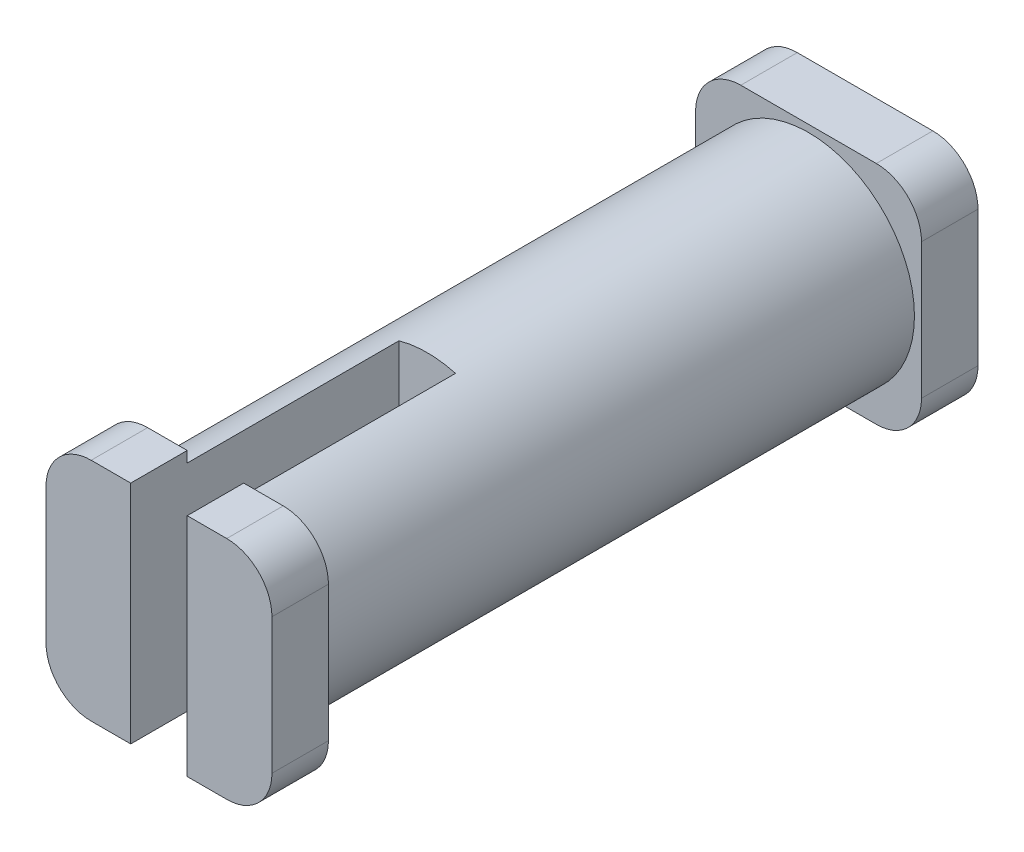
ISO-10303-21;
HEADER;
FILE_DESCRIPTION(('STEP AP214'),'2;1');
FILE_NAME('part.step','',(''),(''),'','','');
FILE_SCHEMA(('AUTOMOTIVE_DESIGN { 1 0 10303 214 1 1 1 1 }'));
ENDSEC;
DATA;
#1=APPLICATION_CONTEXT('core data for automotive mechanical design processes');
#2=APPLICATION_PROTOCOL_DEFINITION('international standard','automotive_design',2000,#1);
#3=PRODUCT_CONTEXT('',#1,'mechanical');
#4=PRODUCT('Part','Part','',(#3));
#5=PRODUCT_RELATED_PRODUCT_CATEGORY('part','',(#4));
#6=PRODUCT_DEFINITION_FORMATION('','',#4);
#7=PRODUCT_DEFINITION_CONTEXT('part definition',#1,'design');
#8=PRODUCT_DEFINITION('design','',#6,#7);
#9=PRODUCT_DEFINITION_SHAPE('','',#8);
#10=(LENGTH_UNIT() NAMED_UNIT(*) SI_UNIT(.MILLI.,.METRE.));
#11=(NAMED_UNIT(*) PLANE_ANGLE_UNIT() SI_UNIT($,.RADIAN.));
#12=(NAMED_UNIT(*) SI_UNIT($,.STERADIAN.) SOLID_ANGLE_UNIT());
#13=UNCERTAINTY_MEASURE_WITH_UNIT(LENGTH_MEASURE(1.E-05),#10,'distance_accuracy_value','');
#14=(GEOMETRIC_REPRESENTATION_CONTEXT(3) GLOBAL_UNCERTAINTY_ASSIGNED_CONTEXT((#13)) GLOBAL_UNIT_ASSIGNED_CONTEXT((#10,
#11,#12)) REPRESENTATION_CONTEXT('',''));
#15=CARTESIAN_POINT('',(0.,0.,0.));
#16=DIRECTION('',(0.,0.,1.));
#17=DIRECTION('',(1.,0.,0.));
#18=AXIS2_PLACEMENT_3D('',#15,#16,#17);
#19=CARTESIAN_POINT('',(1.27000000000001,0.,18.25625));
#20=DIRECTION('',(0.,-1.,0.));
#21=DIRECTION('',(0.,0.,-1.));
#22=AXIS2_PLACEMENT_3D('',#19,#20,#21);
#23=PLANE('',#22);
#24=DIRECTION('',(0.,0.,1.));
#25=VECTOR('',#24,1.);
#26=CARTESIAN_POINT('',(2.38125,0.,12.303125));
#27=LINE('',#26,#25);
#28=CARTESIAN_POINT('',(2.38125,0.,18.25625));
#29=VERTEX_POINT('',#28);
#30=CARTESIAN_POINT('',(2.38125,0.,19.84375));
#31=VERTEX_POINT('',#30);
#32=EDGE_CURVE('E259',#29,#31,#27,.T.);
#33=ORIENTED_EDGE('',*,*,#32,.T.);
#34=DIRECTION('',(1.,0.,0.));
#35=VECTOR('',#34,1.);
#36=CARTESIAN_POINT('',(1.27000000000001,0.,19.84375));
#37=LINE('',#36,#35);
#38=CARTESIAN_POINT('',(1.27000000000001,0.,19.84375));
#39=VERTEX_POINT('',#38);
#40=EDGE_CURVE('E304',#39,#31,#37,.T.);
#41=ORIENTED_EDGE('',*,*,#40,.F.);
#42=DIRECTION('',(0.,0.,1.));
#43=VECTOR('',#42,1.);
#44=CARTESIAN_POINT('',(1.27000000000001,0.,18.25625));
#45=LINE('',#44,#43);
#46=CARTESIAN_POINT('',(1.27000000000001,0.,18.25625));
#47=VERTEX_POINT('',#46);
#48=EDGE_CURVE('E342',#47,#39,#45,.T.);
#49=ORIENTED_EDGE('',*,*,#48,.F.);
#50=DIRECTION('',(1.,0.,0.));
#51=VECTOR('',#50,1.);
#52=CARTESIAN_POINT('',(1.27000000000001,0.,18.25625));
#53=LINE('',#52,#51);
#54=EDGE_CURVE('E273',#47,#29,#53,.T.);
#55=ORIENTED_EDGE('',*,*,#54,.T.);
#56=EDGE_LOOP('',(#33,#41,#49,#55));
#57=FACE_BOUND('',#56,.T.);
#58=ADVANCED_FACE('F36',(#57),#23,.T.);
#59=CARTESIAN_POINT('',(1.27,6.35,18.25625));
#60=DIRECTION('',(0.,1.,0.));
#61=DIRECTION('',(0.,0.,1.));
#62=AXIS2_PLACEMENT_3D('',#59,#60,#61);
#63=PLANE('',#62);
#64=DIRECTION('',(0.,0.,1.));
#65=VECTOR('',#64,1.);
#66=CARTESIAN_POINT('',(2.38125,6.35,12.303125));
#67=LINE('',#66,#65);
#68=CARTESIAN_POINT('',(2.38125,6.35,18.25625));
#69=VERTEX_POINT('',#68);
#70=CARTESIAN_POINT('',(2.38125,6.35,19.84375));
#71=VERTEX_POINT('',#70);
#72=EDGE_CURVE('E468',#69,#71,#67,.T.);
#73=ORIENTED_EDGE('',*,*,#72,.F.);
#74=DIRECTION('',(-1.,0.,0.));
#75=VECTOR('',#74,1.);
#76=CARTESIAN_POINT('',(1.27,6.35,18.25625));
#77=LINE('',#76,#75);
#78=CARTESIAN_POINT('',(1.27,6.35,18.25625));
#79=VERTEX_POINT('',#78);
#80=EDGE_CURVE('E289',#69,#79,#77,.T.);
#81=ORIENTED_EDGE('',*,*,#80,.T.);
#82=DIRECTION('',(0.,0.,1.));
#83=VECTOR('',#82,1.);
#84=CARTESIAN_POINT('',(1.27,6.35,18.25625));
#85=LINE('',#84,#83);
#86=CARTESIAN_POINT('',(1.27,6.35,19.84375));
#87=VERTEX_POINT('',#86);
#88=EDGE_CURVE('E333',#79,#87,#85,.T.);
#89=ORIENTED_EDGE('',*,*,#88,.T.);
#90=DIRECTION('',(-1.,0.,0.));
#91=VECTOR('',#90,1.);
#92=CARTESIAN_POINT('',(1.27,6.35,19.84375));
#93=LINE('',#92,#91);
#94=EDGE_CURVE('E316',#71,#87,#93,.T.);
#95=ORIENTED_EDGE('',*,*,#94,.F.);
#96=EDGE_LOOP('',(#73,#81,#89,#95));
#97=FACE_BOUND('',#96,.T.);
#98=ADVANCED_FACE('F219',(#97),#63,.T.);
#99=CARTESIAN_POINT('',(5.08,1.27,18.25625));
#100=DIRECTION('',(0.,0.,-1.));
#101=DIRECTION('',(1.,0.,0.));
#102=AXIS2_PLACEMENT_3D('',#99,#100,#101);
#103=PLANE('',#102);
#104=DIRECTION('',(0.,1.,0.));
#105=VECTOR('',#104,1.);
#106=CARTESIAN_POINT('',(2.38125,1.27,18.25625));
#107=LINE('',#106,#105);
#108=CARTESIAN_POINT('',(2.38125,0.306222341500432,18.25625));
#109=VERTEX_POINT('',#108);
#110=EDGE_CURVE('E356',#29,#109,#107,.T.);
#111=ORIENTED_EDGE('',*,*,#110,.F.);
#112=ORIENTED_EDGE('',*,*,#54,.F.);
#113=CARTESIAN_POINT('',(1.27,1.27,18.25625));
#114=DIRECTION('',(0.,0.,1.));
#115=DIRECTION('',(-1.,0.,0.));
#116=AXIS2_PLACEMENT_3D('',#113,#114,#115);
#117=CIRCLE('',#116,1.27);
#118=CARTESIAN_POINT('',(0.,1.27,18.25625));
#119=VERTEX_POINT('',#118);
#120=EDGE_CURVE('E276',#119,#47,#117,.T.);
#121=ORIENTED_EDGE('',*,*,#120,.F.);
#122=DIRECTION('',(0.,-1.,0.));
#123=VECTOR('',#122,1.);
#124=CARTESIAN_POINT('',(0.,1.27000000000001,18.25625));
#125=LINE('',#124,#123);
#126=CARTESIAN_POINT('',(0.,5.08,18.25625));
#127=VERTEX_POINT('',#126);
#128=EDGE_CURVE('E283',#127,#119,#125,.T.);
#129=ORIENTED_EDGE('',*,*,#128,.F.);
#130=CARTESIAN_POINT('',(1.27,5.08,18.25625));
#131=DIRECTION('',(0.,0.,1.));
#132=DIRECTION('',(-1.,0.,0.));
#133=AXIS2_PLACEMENT_3D('',#130,#131,#132);
#134=CIRCLE('',#133,1.27);
#135=EDGE_CURVE('E286',#79,#127,#134,.T.);
#136=ORIENTED_EDGE('',*,*,#135,.F.);
#137=ORIENTED_EDGE('',*,*,#80,.F.);
#138=CARTESIAN_POINT('',(2.38125,6.04377765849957,18.25625));
#139=VERTEX_POINT('',#138);
#140=EDGE_CURVE('E360',#139,#69,#107,.T.);
#141=ORIENTED_EDGE('',*,*,#140,.F.);
#142=CARTESIAN_POINT('',(3.175,3.175,18.25625));
#143=DIRECTION('',(0.,0.,1.));
#144=DIRECTION('',(1.,0.,0.));
#145=AXIS2_PLACEMENT_3D('',#142,#143,#144);
#146=CIRCLE('',#145,2.9765625);
#147=EDGE_CURVE('E150',#139,#109,#146,.T.);
#148=ORIENTED_EDGE('',*,*,#147,.T.);
#149=EDGE_LOOP('',(#111,#112,#121,#129,#136,#137,#141,#148));
#150=FACE_BOUND('',#149,.T.);
#151=ADVANCED_FACE('F226',(#150),#103,.T.);
#152=CARTESIAN_POINT('',(5.08,1.27,19.84375));
#153=DIRECTION('',(0.,0.,-1.));
#154=DIRECTION('',(1.,0.,0.));
#155=AXIS2_PLACEMENT_3D('',#152,#153,#154);
#156=PLANE('',#155);
#157=ORIENTED_EDGE('',*,*,#40,.T.);
#158=DIRECTION('',(0.,-1.,0.));
#159=VECTOR('',#158,1.);
#160=CARTESIAN_POINT('',(2.38125,6.35,19.84375));
#161=LINE('',#160,#159);
#162=EDGE_CURVE('E455',#71,#31,#161,.T.);
#163=ORIENTED_EDGE('',*,*,#162,.F.);
#164=ORIENTED_EDGE('',*,*,#94,.T.);
#165=CARTESIAN_POINT('',(1.27,5.08,19.84375));
#166=DIRECTION('',(0.,0.,1.));
#167=DIRECTION('',(-1.,0.,0.));
#168=AXIS2_PLACEMENT_3D('',#165,#166,#167);
#169=CIRCLE('',#168,1.27);
#170=CARTESIAN_POINT('',(0.,5.08,19.84375));
#171=VERTEX_POINT('',#170);
#172=EDGE_CURVE('E313',#87,#171,#169,.T.);
#173=ORIENTED_EDGE('',*,*,#172,.T.);
#174=DIRECTION('',(0.,-1.,0.));
#175=VECTOR('',#174,1.);
#176=CARTESIAN_POINT('',(0.,1.27000000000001,19.84375));
#177=LINE('',#176,#175);
#178=CARTESIAN_POINT('',(0.,1.27,19.84375));
#179=VERTEX_POINT('',#178);
#180=EDGE_CURVE('E310',#171,#179,#177,.T.);
#181=ORIENTED_EDGE('',*,*,#180,.T.);
#182=CARTESIAN_POINT('',(1.27,1.27,19.84375));
#183=DIRECTION('',(0.,0.,1.));
#184=DIRECTION('',(-1.,0.,0.));
#185=AXIS2_PLACEMENT_3D('',#182,#183,#184);
#186=CIRCLE('',#185,1.27);
#187=EDGE_CURVE('E307',#179,#39,#186,.T.);
#188=ORIENTED_EDGE('',*,*,#187,.T.);
#189=EDGE_LOOP('',(#157,#163,#164,#173,#181,#188));
#190=FACE_BOUND('',#189,.T.);
#191=ADVANCED_FACE('F444',(#190),#156,.F.);
#192=CARTESIAN_POINT('',(5.08,1.27,1.5875));
#193=DIRECTION('',(0.,0.,-1.));
#194=DIRECTION('',(-1.,0.,0.));
#195=AXIS2_PLACEMENT_3D('',#192,#193,#194);
#196=CYLINDRICAL_SURFACE('',#195,1.27);
#197=CARTESIAN_POINT('',(5.08,1.27,0.));
#198=DIRECTION('',(0.,0.,1.));
#199=DIRECTION('',(1.,0.,0.));
#200=AXIS2_PLACEMENT_3D('',#197,#198,#199);
#201=CIRCLE('',#200,1.27);
#202=CARTESIAN_POINT('',(5.08,0.,0.));
#203=VERTEX_POINT('',#202);
#204=CARTESIAN_POINT('',(6.35,1.27,0.));
#205=VERTEX_POINT('',#204);
#206=EDGE_CURVE('E146',#203,#205,#201,.T.);
#207=ORIENTED_EDGE('',*,*,#206,.T.);
#208=DIRECTION('',(0.,0.,-1.));
#209=VECTOR('',#208,1.);
#210=CARTESIAN_POINT('',(6.35,1.27,1.5875));
#211=LINE('',#210,#209);
#212=CARTESIAN_POINT('',(6.35,1.27,1.5875));
#213=VERTEX_POINT('',#212);
#214=EDGE_CURVE('E174',#213,#205,#211,.T.);
#215=ORIENTED_EDGE('',*,*,#214,.F.);
#216=CARTESIAN_POINT('',(5.08,1.27,1.5875));
#217=DIRECTION('',(0.,0.,1.));
#218=DIRECTION('',(1.,0.,0.));
#219=AXIS2_PLACEMENT_3D('',#216,#217,#218);
#220=CIRCLE('',#219,1.27);
#221=CARTESIAN_POINT('',(5.08,0.,1.5875));
#222=VERTEX_POINT('',#221);
#223=EDGE_CURVE('E162',#222,#213,#220,.T.);
#224=ORIENTED_EDGE('',*,*,#223,.F.);
#225=DIRECTION('',(0.,0.,-1.));
#226=VECTOR('',#225,1.);
#227=CARTESIAN_POINT('',(5.08,0.,1.5875));
#228=LINE('',#227,#226);
#229=EDGE_CURVE('E142',#222,#203,#228,.T.);
#230=ORIENTED_EDGE('',*,*,#229,.T.);
#231=EDGE_LOOP('',(#207,#215,#224,#230));
#232=FACE_BOUND('',#231,.T.);
#233=ADVANCED_FACE('F38',(#232),#196,.T.);
#234=CARTESIAN_POINT('',(6.35,1.27,1.5875));
#235=DIRECTION('',(-1.,0.,0.));
#236=DIRECTION('',(0.,-1.,0.));
#237=AXIS2_PLACEMENT_3D('',#234,#235,#236);
#238=PLANE('',#237);
#239=DIRECTION('',(0.,1.,0.));
#240=VECTOR('',#239,1.);
#241=CARTESIAN_POINT('',(6.35,1.27,0.));
#242=LINE('',#241,#240);
#243=CARTESIAN_POINT('',(6.35,5.08,0.));
#244=VERTEX_POINT('',#243);
#245=EDGE_CURVE('E149',#205,#244,#242,.T.);
#246=ORIENTED_EDGE('',*,*,#245,.T.);
#247=DIRECTION('',(0.,0.,-1.));
#248=VECTOR('',#247,1.);
#249=CARTESIAN_POINT('',(6.35,5.08,1.5875));
#250=LINE('',#249,#248);
#251=CARTESIAN_POINT('',(6.35,5.08,1.5875));
#252=VERTEX_POINT('',#251);
#253=EDGE_CURVE('E172',#252,#244,#250,.T.);
#254=ORIENTED_EDGE('',*,*,#253,.F.);
#255=DIRECTION('',(0.,1.,0.));
#256=VECTOR('',#255,1.);
#257=CARTESIAN_POINT('',(6.35,1.27,1.5875));
#258=LINE('',#257,#256);
#259=EDGE_CURVE('E102',#213,#252,#258,.T.);
#260=ORIENTED_EDGE('',*,*,#259,.F.);
#261=ORIENTED_EDGE('',*,*,#214,.T.);
#262=EDGE_LOOP('',(#246,#254,#260,#261));
#263=FACE_BOUND('',#262,.T.);
#264=ADVANCED_FACE('F207',(#263),#238,.F.);
#265=CARTESIAN_POINT('',(5.08,5.08,1.5875));
#266=DIRECTION('',(0.,0.,-1.));
#267=DIRECTION('',(-1.,0.,0.));
#268=AXIS2_PLACEMENT_3D('',#265,#266,#267);
#269=CYLINDRICAL_SURFACE('',#268,1.27);
#270=CARTESIAN_POINT('',(5.08,5.08,0.));
#271=DIRECTION('',(0.,0.,1.));
#272=DIRECTION('',(-1.,0.,0.));
#273=AXIS2_PLACEMENT_3D('',#270,#271,#272);
#274=CIRCLE('',#273,1.27);
#275=CARTESIAN_POINT('',(5.08,6.35,0.));
#276=VERTEX_POINT('',#275);
#277=EDGE_CURVE('E152',#244,#276,#274,.T.);
#278=ORIENTED_EDGE('',*,*,#277,.T.);
#279=DIRECTION('',(0.,0.,-1.));
#280=VECTOR('',#279,1.);
#281=CARTESIAN_POINT('',(5.08,6.35,1.5875));
#282=LINE('',#281,#280);
#283=CARTESIAN_POINT('',(5.08,6.35,1.5875));
#284=VERTEX_POINT('',#283);
#285=EDGE_CURVE('E169',#284,#276,#282,.T.);
#286=ORIENTED_EDGE('',*,*,#285,.F.);
#287=CARTESIAN_POINT('',(5.08,5.08,1.5875));
#288=DIRECTION('',(0.,0.,1.));
#289=DIRECTION('',(-1.,0.,0.));
#290=AXIS2_PLACEMENT_3D('',#287,#288,#289);
#291=CIRCLE('',#290,1.27);
#292=EDGE_CURVE('E188',#252,#284,#291,.T.);
#293=ORIENTED_EDGE('',*,*,#292,.F.);
#294=ORIENTED_EDGE('',*,*,#253,.T.);
#295=EDGE_LOOP('',(#278,#286,#293,#294));
#296=FACE_BOUND('',#295,.T.);
#297=ADVANCED_FACE('F210',(#296),#269,.T.);
#298=CARTESIAN_POINT('',(1.27,6.35,1.5875));
#299=DIRECTION('',(0.,-1.,0.));
#300=DIRECTION('',(0.,0.,-1.));
#301=AXIS2_PLACEMENT_3D('',#298,#299,#300);
#302=PLANE('',#301);
#303=DIRECTION('',(-1.,0.,0.));
#304=VECTOR('',#303,1.);
#305=CARTESIAN_POINT('',(1.27,6.35,0.));
#306=LINE('',#305,#304);
#307=CARTESIAN_POINT('',(1.27,6.35,0.));
#308=VERTEX_POINT('',#307);
#309=EDGE_CURVE('E154',#276,#308,#306,.T.);
#310=ORIENTED_EDGE('',*,*,#309,.T.);
#311=DIRECTION('',(0.,0.,-1.));
#312=VECTOR('',#311,1.);
#313=CARTESIAN_POINT('',(1.27,6.35,1.5875));
#314=LINE('',#313,#312);
#315=CARTESIAN_POINT('',(1.27,6.35,1.5875));
#316=VERTEX_POINT('',#315);
#317=EDGE_CURVE('E166',#316,#308,#314,.T.);
#318=ORIENTED_EDGE('',*,*,#317,.F.);
#319=DIRECTION('',(-1.,0.,0.));
#320=VECTOR('',#319,1.);
#321=CARTESIAN_POINT('',(1.27,6.35,1.5875));
#322=LINE('',#321,#320);
#323=EDGE_CURVE('E190',#284,#316,#322,.T.);
#324=ORIENTED_EDGE('',*,*,#323,.F.);
#325=ORIENTED_EDGE('',*,*,#285,.T.);
#326=EDGE_LOOP('',(#310,#318,#324,#325));
#327=FACE_BOUND('',#326,.T.);
#328=ADVANCED_FACE('F196',(#327),#302,.F.);
#329=CARTESIAN_POINT('',(1.27,5.08,1.5875));
#330=DIRECTION('',(0.,0.,-1.));
#331=DIRECTION('',(-1.,0.,0.));
#332=AXIS2_PLACEMENT_3D('',#329,#330,#331);
#333=CYLINDRICAL_SURFACE('',#332,1.27);
#334=CARTESIAN_POINT('',(1.27,5.08,0.));
#335=DIRECTION('',(0.,0.,1.));
#336=DIRECTION('',(-1.,0.,0.));
#337=AXIS2_PLACEMENT_3D('',#334,#335,#336);
#338=CIRCLE('',#337,1.27);
#339=CARTESIAN_POINT('',(0.,5.08,0.));
#340=VERTEX_POINT('',#339);
#341=EDGE_CURVE('E156',#308,#340,#338,.T.);
#342=ORIENTED_EDGE('',*,*,#341,.T.);
#343=DIRECTION('',(0.,0.,-1.));
#344=VECTOR('',#343,1.);
#345=CARTESIAN_POINT('',(0.,5.08,1.5875));
#346=LINE('',#345,#344);
#347=CARTESIAN_POINT('',(0.,5.08,1.5875));
#348=VERTEX_POINT('',#347);
#349=EDGE_CURVE('E137',#348,#340,#346,.T.);
#350=ORIENTED_EDGE('',*,*,#349,.F.);
#351=CARTESIAN_POINT('',(1.27,5.08,1.5875));
#352=DIRECTION('',(0.,0.,1.));
#353=DIRECTION('',(-1.,0.,0.));
#354=AXIS2_PLACEMENT_3D('',#351,#352,#353);
#355=CIRCLE('',#354,1.27);
#356=EDGE_CURVE('E125',#316,#348,#355,.T.);
#357=ORIENTED_EDGE('',*,*,#356,.F.);
#358=ORIENTED_EDGE('',*,*,#317,.T.);
#359=EDGE_LOOP('',(#342,#350,#357,#358));
#360=FACE_BOUND('',#359,.T.);
#361=ADVANCED_FACE('F200',(#360),#333,.T.);
#362=CARTESIAN_POINT('',(0.,1.27000000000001,1.5875));
#363=DIRECTION('',(1.,0.,0.));
#364=DIRECTION('',(0.,1.,0.));
#365=AXIS2_PLACEMENT_3D('',#362,#363,#364);
#366=PLANE('',#365);
#367=DIRECTION('',(0.,-1.,0.));
#368=VECTOR('',#367,1.);
#369=CARTESIAN_POINT('',(0.,1.27000000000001,0.));
#370=LINE('',#369,#368);
#371=CARTESIAN_POINT('',(0.,1.27,0.));
#372=VERTEX_POINT('',#371);
#373=EDGE_CURVE('E134',#340,#372,#370,.T.);
#374=ORIENTED_EDGE('',*,*,#373,.T.);
#375=DIRECTION('',(0.,0.,-1.));
#376=VECTOR('',#375,1.);
#377=CARTESIAN_POINT('',(0.,1.27,1.5875));
#378=LINE('',#377,#376);
#379=CARTESIAN_POINT('',(0.,1.27,1.5875));
#380=VERTEX_POINT('',#379);
#381=EDGE_CURVE('E131',#380,#372,#378,.T.);
#382=ORIENTED_EDGE('',*,*,#381,.F.);
#383=DIRECTION('',(0.,-1.,0.));
#384=VECTOR('',#383,1.);
#385=CARTESIAN_POINT('',(0.,1.27000000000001,1.5875));
#386=LINE('',#385,#384);
#387=EDGE_CURVE('E118',#348,#380,#386,.T.);
#388=ORIENTED_EDGE('',*,*,#387,.F.);
#389=ORIENTED_EDGE('',*,*,#349,.T.);
#390=EDGE_LOOP('',(#374,#382,#388,#389));
#391=FACE_BOUND('',#390,.T.);
#392=ADVANCED_FACE('F132',(#391),#366,.F.);
#393=CARTESIAN_POINT('',(1.27,1.27,1.5875));
#394=DIRECTION('',(0.,0.,-1.));
#395=DIRECTION('',(-1.,0.,0.));
#396=AXIS2_PLACEMENT_3D('',#393,#394,#395);
#397=CYLINDRICAL_SURFACE('',#396,1.27);
#398=CARTESIAN_POINT('',(1.27,1.27,0.));
#399=DIRECTION('',(0.,0.,1.));
#400=DIRECTION('',(-1.,0.,0.));
#401=AXIS2_PLACEMENT_3D('',#398,#399,#400);
#402=CIRCLE('',#401,1.27);
#403=CARTESIAN_POINT('',(1.27000000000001,0.,0.));
#404=VERTEX_POINT('',#403);
#405=EDGE_CURVE('E159',#372,#404,#402,.T.);
#406=ORIENTED_EDGE('',*,*,#405,.T.);
#407=DIRECTION('',(0.,0.,-1.));
#408=VECTOR('',#407,1.);
#409=CARTESIAN_POINT('',(1.27000000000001,0.,1.5875));
#410=LINE('',#409,#408);
#411=CARTESIAN_POINT('',(1.27000000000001,0.,1.5875));
#412=VERTEX_POINT('',#411);
#413=EDGE_CURVE('E138',#412,#404,#410,.T.);
#414=ORIENTED_EDGE('',*,*,#413,.F.);
#415=CARTESIAN_POINT('',(1.27,1.27,1.5875));
#416=DIRECTION('',(0.,0.,1.));
#417=DIRECTION('',(-1.,0.,0.));
#418=AXIS2_PLACEMENT_3D('',#415,#416,#417);
#419=CIRCLE('',#418,1.27);
#420=EDGE_CURVE('E122',#380,#412,#419,.T.);
#421=ORIENTED_EDGE('',*,*,#420,.F.);
#422=ORIENTED_EDGE('',*,*,#381,.T.);
#423=EDGE_LOOP('',(#406,#414,#421,#422));
#424=FACE_BOUND('',#423,.T.);
#425=ADVANCED_FACE('F140',(#424),#397,.T.);
#426=CARTESIAN_POINT('',(1.27000000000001,0.,1.5875));
#427=DIRECTION('',(0.,1.,0.));
#428=DIRECTION('',(0.,0.,1.));
#429=AXIS2_PLACEMENT_3D('',#426,#427,#428);
#430=PLANE('',#429);
#431=DIRECTION('',(1.,0.,0.));
#432=VECTOR('',#431,1.);
#433=CARTESIAN_POINT('',(1.27000000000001,0.,0.));
#434=LINE('',#433,#432);
#435=EDGE_CURVE('E93',#404,#203,#434,.T.);
#436=ORIENTED_EDGE('',*,*,#435,.T.);
#437=ORIENTED_EDGE('',*,*,#229,.F.);
#438=DIRECTION('',(1.,0.,0.));
#439=VECTOR('',#438,1.);
#440=CARTESIAN_POINT('',(1.27000000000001,0.,1.5875));
#441=LINE('',#440,#439);
#442=EDGE_CURVE('E60',#412,#222,#441,.T.);
#443=ORIENTED_EDGE('',*,*,#442,.F.);
#444=ORIENTED_EDGE('',*,*,#413,.T.);
#445=EDGE_LOOP('',(#436,#437,#443,#444));
#446=FACE_BOUND('',#445,.T.);
#447=ADVANCED_FACE('F204',(#446),#430,.F.);
#448=CARTESIAN_POINT('',(5.08,1.27,1.5875));
#449=DIRECTION('',(0.,0.,1.));
#450=DIRECTION('',(1.,0.,0.));
#451=AXIS2_PLACEMENT_3D('',#448,#449,#450);
#452=PLANE('',#451);
#453=CARTESIAN_POINT('',(3.175,3.175,1.5875));
#454=DIRECTION('',(0.,0.,1.));
#455=DIRECTION('',(1.,0.,0.));
#456=AXIS2_PLACEMENT_3D('',#453,#454,#455);
#457=CIRCLE('',#456,2.9765625);
#458=CARTESIAN_POINT('',(6.1515625,3.175,1.5875));
#459=VERTEX_POINT('',#458);
#460=EDGE_CURVE('E175',#459,#459,#457,.T.);
#461=ORIENTED_EDGE('',*,*,#460,.F.);
#462=EDGE_LOOP('',(#461));
#463=FACE_BOUND('',#462,.T.);
#464=ORIENTED_EDGE('',*,*,#223,.T.);
#465=ORIENTED_EDGE('',*,*,#259,.T.);
#466=ORIENTED_EDGE('',*,*,#292,.T.);
#467=ORIENTED_EDGE('',*,*,#323,.T.);
#468=ORIENTED_EDGE('',*,*,#356,.T.);
#469=ORIENTED_EDGE('',*,*,#387,.T.);
#470=ORIENTED_EDGE('',*,*,#420,.T.);
#471=ORIENTED_EDGE('',*,*,#442,.T.);
#472=EDGE_LOOP('',(#464,#465,#466,#467,#468,#469,#470,#471));
#473=FACE_BOUND('',#472,.T.);
#474=ADVANCED_FACE('F120',(#463,#473),#452,.T.);
#475=CARTESIAN_POINT('',(5.08,1.27,0.));
#476=DIRECTION('',(0.,0.,1.));
#477=DIRECTION('',(1.,0.,0.));
#478=AXIS2_PLACEMENT_3D('',#475,#476,#477);
#479=PLANE('',#478);
#480=ORIENTED_EDGE('',*,*,#206,.F.);
#481=ORIENTED_EDGE('',*,*,#435,.F.);
#482=ORIENTED_EDGE('',*,*,#405,.F.);
#483=ORIENTED_EDGE('',*,*,#373,.F.);
#484=ORIENTED_EDGE('',*,*,#341,.F.);
#485=ORIENTED_EDGE('',*,*,#309,.F.);
#486=ORIENTED_EDGE('',*,*,#277,.F.);
#487=ORIENTED_EDGE('',*,*,#245,.F.);
#488=EDGE_LOOP('',(#480,#481,#482,#483,#484,#485,#486,#487));
#489=FACE_BOUND('',#488,.T.);
#490=ADVANCED_FACE('F203',(#489),#479,.F.);
#491=CARTESIAN_POINT('',(3.175,3.175,18.25625));
#492=DIRECTION('',(0.,0.,-1.));
#493=DIRECTION('',(-1.,0.,0.));
#494=AXIS2_PLACEMENT_3D('',#491,#492,#493);
#495=CYLINDRICAL_SURFACE('',#494,2.9765625);
#496=ORIENTED_EDGE('',*,*,#147,.F.);
#497=DIRECTION('',(0.,0.,-1.));
#498=VECTOR('',#497,1.);
#499=CARTESIAN_POINT('',(2.38125,6.04377765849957,18.25625));
#500=LINE('',#499,#498);
#501=CARTESIAN_POINT('',(2.38125,6.04377765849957,12.303125));
#502=VERTEX_POINT('',#501);
#503=EDGE_CURVE('E368',#139,#502,#500,.T.);
#504=ORIENTED_EDGE('',*,*,#503,.T.);
#505=CARTESIAN_POINT('',(3.175,3.175,12.303125));
#506=DIRECTION('',(0.,0.,1.));
#507=DIRECTION('',(1.,0.,0.));
#508=AXIS2_PLACEMENT_3D('',#505,#506,#507);
#509=CIRCLE('',#508,2.9765625);
#510=CARTESIAN_POINT('',(3.96875,6.04377765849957,12.303125));
#511=VERTEX_POINT('',#510);
#512=EDGE_CURVE('E11',#511,#502,#509,.T.);
#513=ORIENTED_EDGE('',*,*,#512,.F.);
#514=DIRECTION('',(0.,0.,-1.));
#515=VECTOR('',#514,1.);
#516=CARTESIAN_POINT('',(3.96875,6.04377765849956,18.25625));
#517=LINE('',#516,#515);
#518=CARTESIAN_POINT('',(3.96875,6.04377765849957,18.25625));
#519=VERTEX_POINT('',#518);
#520=EDGE_CURVE('E472',#511,#519,#517,.F.);
#521=ORIENTED_EDGE('',*,*,#520,.T.);
#522=CARTESIAN_POINT('',(3.96875,0.306222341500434,18.25625));
#523=VERTEX_POINT('',#522);
#524=EDGE_CURVE('E184',#523,#519,#146,.T.);
#525=ORIENTED_EDGE('',*,*,#524,.F.);
#526=DIRECTION('',(0.,0.,-1.));
#527=VECTOR('',#526,1.);
#528=CARTESIAN_POINT('',(3.96875,0.306222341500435,18.25625));
#529=LINE('',#528,#527);
#530=CARTESIAN_POINT('',(3.96875,0.306222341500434,12.303125));
#531=VERTEX_POINT('',#530);
#532=EDGE_CURVE('E467',#523,#531,#529,.T.);
#533=ORIENTED_EDGE('',*,*,#532,.T.);
#534=CARTESIAN_POINT('',(2.38125,0.306222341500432,12.303125));
#535=VERTEX_POINT('',#534);
#536=EDGE_CURVE('E40',#535,#531,#509,.T.);
#537=ORIENTED_EDGE('',*,*,#536,.F.);
#538=DIRECTION('',(0.,0.,-1.));
#539=VECTOR('',#538,1.);
#540=CARTESIAN_POINT('',(2.38125,0.306222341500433,18.25625));
#541=LINE('',#540,#539);
#542=EDGE_CURVE('E303',#535,#109,#541,.F.);
#543=ORIENTED_EDGE('',*,*,#542,.T.);
#544=EDGE_LOOP('',(#496,#504,#513,#521,#525,#533,#537,#543));
#545=FACE_BOUND('',#544,.T.);
#546=ORIENTED_EDGE('',*,*,#460,.T.);
#547=EDGE_LOOP('',(#546));
#548=FACE_BOUND('',#547,.T.);
#549=ADVANCED_FACE('F243',(#545,#548),#495,.T.);
#550=CARTESIAN_POINT('',(5.08,1.27,18.25625));
#551=DIRECTION('',(0.,0.,1.));
#552=DIRECTION('',(1.,0.,0.));
#553=AXIS2_PLACEMENT_3D('',#550,#551,#552);
#554=CYLINDRICAL_SURFACE('',#553,1.27);
#555=CARTESIAN_POINT('',(5.08,1.27,19.84375));
#556=DIRECTION('',(0.,0.,1.));
#557=DIRECTION('',(1.,0.,0.));
#558=AXIS2_PLACEMENT_3D('',#555,#556,#557);
#559=CIRCLE('',#558,1.27);
#560=CARTESIAN_POINT('',(5.08,0.,19.84375));
#561=VERTEX_POINT('',#560);
#562=CARTESIAN_POINT('',(6.35,1.27,19.84375));
#563=VERTEX_POINT('',#562);
#564=EDGE_CURVE('E300',#561,#563,#559,.T.);
#565=ORIENTED_EDGE('',*,*,#564,.F.);
#566=DIRECTION('',(0.,0.,1.));
#567=VECTOR('',#566,1.);
#568=CARTESIAN_POINT('',(5.08,0.,18.25625));
#569=LINE('',#568,#567);
#570=CARTESIAN_POINT('',(5.08,0.,18.25625));
#571=VERTEX_POINT('',#570);
#572=EDGE_CURVE('E344',#571,#561,#569,.T.);
#573=ORIENTED_EDGE('',*,*,#572,.F.);
#574=CARTESIAN_POINT('',(5.08,1.27,18.25625));
#575=DIRECTION('',(0.,0.,1.));
#576=DIRECTION('',(1.,0.,0.));
#577=AXIS2_PLACEMENT_3D('',#574,#575,#576);
#578=CIRCLE('',#577,1.27);
#579=CARTESIAN_POINT('',(6.35,1.27,18.25625));
#580=VERTEX_POINT('',#579);
#581=EDGE_CURVE('E272',#571,#580,#578,.T.);
#582=ORIENTED_EDGE('',*,*,#581,.T.);
#583=DIRECTION('',(0.,0.,1.));
#584=VECTOR('',#583,1.);
#585=CARTESIAN_POINT('',(6.35,1.27,18.25625));
#586=LINE('',#585,#584);
#587=EDGE_CURVE('E299',#580,#563,#586,.T.);
#588=ORIENTED_EDGE('',*,*,#587,.T.);
#589=EDGE_LOOP('',(#565,#573,#582,#588));
#590=FACE_BOUND('',#589,.T.);
#591=ADVANCED_FACE('F235',(#590),#554,.T.);
#592=DIRECTION('',(0.,0.,1.));
#593=VECTOR('',#592,1.);
#594=CARTESIAN_POINT('',(3.96875,0.,12.303125));
#595=LINE('',#594,#593);
#596=CARTESIAN_POINT('',(3.96875,0.,18.25625));
#597=VERTEX_POINT('',#596);
#598=CARTESIAN_POINT('',(3.96875,0.,19.84375));
#599=VERTEX_POINT('',#598);
#600=EDGE_CURVE('E51',#597,#599,#595,.T.);
#601=ORIENTED_EDGE('',*,*,#600,.F.);
#602=EDGE_CURVE('E251',#597,#571,#53,.T.);
#603=ORIENTED_EDGE('',*,*,#602,.T.);
#604=ORIENTED_EDGE('',*,*,#572,.T.);
#605=EDGE_CURVE('E254',#599,#561,#37,.T.);
#606=ORIENTED_EDGE('',*,*,#605,.F.);
#607=EDGE_LOOP('',(#601,#603,#604,#606));
#608=FACE_BOUND('',#607,.T.);
#609=ADVANCED_FACE('F222',(#608),#23,.T.);
#610=CARTESIAN_POINT('',(1.27,1.27,18.25625));
#611=DIRECTION('',(0.,0.,1.));
#612=DIRECTION('',(1.,0.,0.));
#613=AXIS2_PLACEMENT_3D('',#610,#611,#612);
#614=CYLINDRICAL_SURFACE('',#613,1.27);
#615=ORIENTED_EDGE('',*,*,#187,.F.);
#616=DIRECTION('',(0.,0.,1.));
#617=VECTOR('',#616,1.);
#618=CARTESIAN_POINT('',(0.,1.27,18.25625));
#619=LINE('',#618,#617);
#620=EDGE_CURVE('E339',#119,#179,#619,.T.);
#621=ORIENTED_EDGE('',*,*,#620,.F.);
#622=ORIENTED_EDGE('',*,*,#120,.T.);
#623=ORIENTED_EDGE('',*,*,#48,.T.);
#624=EDGE_LOOP('',(#615,#621,#622,#623));
#625=FACE_BOUND('',#624,.T.);
#626=ADVANCED_FACE('F234',(#625),#614,.T.);
#627=CARTESIAN_POINT('',(0.,1.27000000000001,18.25625));
#628=DIRECTION('',(-1.,0.,0.));
#629=DIRECTION('',(0.,-1.,0.));
#630=AXIS2_PLACEMENT_3D('',#627,#628,#629);
#631=PLANE('',#630);
#632=ORIENTED_EDGE('',*,*,#180,.F.);
#633=DIRECTION('',(0.,0.,1.));
#634=VECTOR('',#633,1.);
#635=CARTESIAN_POINT('',(0.,5.08,18.25625));
#636=LINE('',#635,#634);
#637=EDGE_CURVE('E336',#127,#171,#636,.T.);
#638=ORIENTED_EDGE('',*,*,#637,.F.);
#639=ORIENTED_EDGE('',*,*,#128,.T.);
#640=ORIENTED_EDGE('',*,*,#620,.T.);
#641=EDGE_LOOP('',(#632,#638,#639,#640));
#642=FACE_BOUND('',#641,.T.);
#643=ADVANCED_FACE('F241',(#642),#631,.T.);
#644=CARTESIAN_POINT('',(1.27,5.08,18.25625));
#645=DIRECTION('',(0.,0.,1.));
#646=DIRECTION('',(1.,0.,0.));
#647=AXIS2_PLACEMENT_3D('',#644,#645,#646);
#648=CYLINDRICAL_SURFACE('',#647,1.27);
#649=ORIENTED_EDGE('',*,*,#172,.F.);
#650=ORIENTED_EDGE('',*,*,#88,.F.);
#651=ORIENTED_EDGE('',*,*,#135,.T.);
#652=ORIENTED_EDGE('',*,*,#637,.T.);
#653=EDGE_LOOP('',(#649,#650,#651,#652));
#654=FACE_BOUND('',#653,.T.);
#655=ADVANCED_FACE('F430',(#654),#648,.T.);
#656=DIRECTION('',(0.,0.,1.));
#657=VECTOR('',#656,1.);
#658=CARTESIAN_POINT('',(3.96875,6.35,12.303125));
#659=LINE('',#658,#657);
#660=CARTESIAN_POINT('',(3.96875,6.35,18.25625));
#661=VERTEX_POINT('',#660);
#662=CARTESIAN_POINT('',(3.96875,6.35,19.84375));
#663=VERTEX_POINT('',#662);
#664=EDGE_CURVE('E258',#661,#663,#659,.T.);
#665=ORIENTED_EDGE('',*,*,#664,.T.);
#666=CARTESIAN_POINT('',(5.08,6.35,19.84375));
#667=VERTEX_POINT('',#666);
#668=EDGE_CURVE('E317',#667,#663,#93,.T.);
#669=ORIENTED_EDGE('',*,*,#668,.F.);
#670=DIRECTION('',(0.,0.,1.));
#671=VECTOR('',#670,1.);
#672=CARTESIAN_POINT('',(5.08,6.35,18.25625));
#673=LINE('',#672,#671);
#674=CARTESIAN_POINT('',(5.08,6.35,18.25625));
#675=VERTEX_POINT('',#674);
#676=EDGE_CURVE('E330',#675,#667,#673,.T.);
#677=ORIENTED_EDGE('',*,*,#676,.F.);
#678=EDGE_CURVE('E290',#675,#661,#77,.T.);
#679=ORIENTED_EDGE('',*,*,#678,.T.);
#680=EDGE_LOOP('',(#665,#669,#677,#679));
#681=FACE_BOUND('',#680,.T.);
#682=ADVANCED_FACE('F229',(#681),#63,.T.);
#683=CARTESIAN_POINT('',(5.08,5.08,18.25625));
#684=DIRECTION('',(0.,0.,1.));
#685=DIRECTION('',(1.,0.,0.));
#686=AXIS2_PLACEMENT_3D('',#683,#684,#685);
#687=CYLINDRICAL_SURFACE('',#686,1.27);
#688=CARTESIAN_POINT('',(5.08,5.08,19.84375));
#689=DIRECTION('',(0.,0.,1.));
#690=DIRECTION('',(-1.,0.,0.));
#691=AXIS2_PLACEMENT_3D('',#688,#689,#690);
#692=CIRCLE('',#691,1.27);
#693=CARTESIAN_POINT('',(6.35,5.08,19.84375));
#694=VERTEX_POINT('',#693);
#695=EDGE_CURVE('E320',#694,#667,#692,.T.);
#696=ORIENTED_EDGE('',*,*,#695,.F.);
#697=DIRECTION('',(0.,0.,1.));
#698=VECTOR('',#697,1.);
#699=CARTESIAN_POINT('',(6.35,5.08,18.25625));
#700=LINE('',#699,#698);
#701=CARTESIAN_POINT('',(6.35,5.08,18.25625));
#702=VERTEX_POINT('',#701);
#703=EDGE_CURVE('E327',#702,#694,#700,.T.);
#704=ORIENTED_EDGE('',*,*,#703,.F.);
#705=CARTESIAN_POINT('',(5.08,5.08,18.25625));
#706=DIRECTION('',(0.,0.,1.));
#707=DIRECTION('',(-1.,0.,0.));
#708=AXIS2_PLACEMENT_3D('',#705,#706,#707);
#709=CIRCLE('',#708,1.27);
#710=EDGE_CURVE('E293',#702,#675,#709,.T.);
#711=ORIENTED_EDGE('',*,*,#710,.T.);
#712=ORIENTED_EDGE('',*,*,#676,.T.);
#713=EDGE_LOOP('',(#696,#704,#711,#712));
#714=FACE_BOUND('',#713,.T.);
#715=ADVANCED_FACE('F418',(#714),#687,.T.);
#716=CARTESIAN_POINT('',(6.35,1.27,18.25625));
#717=DIRECTION('',(1.,0.,0.));
#718=DIRECTION('',(0.,1.,0.));
#719=AXIS2_PLACEMENT_3D('',#716,#717,#718);
#720=PLANE('',#719);
#721=DIRECTION('',(0.,1.,0.));
#722=VECTOR('',#721,1.);
#723=CARTESIAN_POINT('',(6.35,1.27,19.84375));
#724=LINE('',#723,#722);
#725=EDGE_CURVE('E277',#563,#694,#724,.T.);
#726=ORIENTED_EDGE('',*,*,#725,.F.);
#727=ORIENTED_EDGE('',*,*,#587,.F.);
#728=DIRECTION('',(0.,1.,0.));
#729=VECTOR('',#728,1.);
#730=CARTESIAN_POINT('',(6.35,1.27,18.25625));
#731=LINE('',#730,#729);
#732=EDGE_CURVE('E296',#580,#702,#731,.T.);
#733=ORIENTED_EDGE('',*,*,#732,.T.);
#734=ORIENTED_EDGE('',*,*,#703,.T.);
#735=EDGE_LOOP('',(#726,#727,#733,#734));
#736=FACE_BOUND('',#735,.T.);
#737=ADVANCED_FACE('F416',(#736),#720,.T.);
#738=DIRECTION('',(0.,-1.,0.));
#739=VECTOR('',#738,1.);
#740=CARTESIAN_POINT('',(3.96875,1.27,18.25625));
#741=LINE('',#740,#739);
#742=EDGE_CURVE('E469',#661,#519,#741,.T.);
#743=ORIENTED_EDGE('',*,*,#742,.F.);
#744=ORIENTED_EDGE('',*,*,#678,.F.);
#745=ORIENTED_EDGE('',*,*,#710,.F.);
#746=ORIENTED_EDGE('',*,*,#732,.F.);
#747=ORIENTED_EDGE('',*,*,#581,.F.);
#748=ORIENTED_EDGE('',*,*,#602,.F.);
#749=EDGE_CURVE('E268',#523,#597,#741,.T.);
#750=ORIENTED_EDGE('',*,*,#749,.F.);
#751=ORIENTED_EDGE('',*,*,#524,.T.);
#752=EDGE_LOOP('',(#743,#744,#745,#746,#747,#748,#750,#751));
#753=FACE_BOUND('',#752,.T.);
#754=ADVANCED_FACE('F265',(#753),#103,.T.);
#755=ORIENTED_EDGE('',*,*,#668,.T.);
#756=DIRECTION('',(0.,1.,0.));
#757=VECTOR('',#756,1.);
#758=CARTESIAN_POINT('',(3.96875,6.35,19.84375));
#759=LINE('',#758,#757);
#760=EDGE_CURVE('E481',#599,#663,#759,.T.);
#761=ORIENTED_EDGE('',*,*,#760,.F.);
#762=ORIENTED_EDGE('',*,*,#605,.T.);
#763=ORIENTED_EDGE('',*,*,#564,.T.);
#764=ORIENTED_EDGE('',*,*,#725,.T.);
#765=ORIENTED_EDGE('',*,*,#695,.T.);
#766=EDGE_LOOP('',(#755,#761,#762,#763,#764,#765));
#767=FACE_BOUND('',#766,.T.);
#768=ADVANCED_FACE('F415',(#767),#156,.F.);
#769=CARTESIAN_POINT('',(0.,0.,12.303125));
#770=DIRECTION('',(0.,0.,1.));
#771=DIRECTION('',(1.,0.,0.));
#772=AXIS2_PLACEMENT_3D('',#769,#770,#771);
#773=PLANE('',#772);
#774=ORIENTED_EDGE('',*,*,#512,.T.);
#775=DIRECTION('',(0.,-1.,0.));
#776=VECTOR('',#775,1.);
#777=CARTESIAN_POINT('',(2.38125,6.35,12.303125));
#778=LINE('',#777,#776);
#779=EDGE_CURVE('E462',#502,#535,#778,.T.);
#780=ORIENTED_EDGE('',*,*,#779,.T.);
#781=ORIENTED_EDGE('',*,*,#536,.T.);
#782=DIRECTION('',(0.,1.,0.));
#783=VECTOR('',#782,1.);
#784=CARTESIAN_POINT('',(3.96875,6.35,12.303125));
#785=LINE('',#784,#783);
#786=EDGE_CURVE('E459',#531,#511,#785,.T.);
#787=ORIENTED_EDGE('',*,*,#786,.T.);
#788=EDGE_LOOP('',(#774,#780,#781,#787));
#789=FACE_BOUND('',#788,.T.);
#790=ADVANCED_FACE('F479',(#789),#773,.T.);
#791=CARTESIAN_POINT('',(2.38125,6.35,12.303125));
#792=DIRECTION('',(-1.,0.,0.));
#793=DIRECTION('',(0.,-1.,0.));
#794=AXIS2_PLACEMENT_3D('',#791,#792,#793);
#795=PLANE('',#794);
#796=ORIENTED_EDGE('',*,*,#779,.F.);
#797=ORIENTED_EDGE('',*,*,#503,.F.);
#798=ORIENTED_EDGE('',*,*,#140,.T.);
#799=ORIENTED_EDGE('',*,*,#72,.T.);
#800=ORIENTED_EDGE('',*,*,#162,.T.);
#801=ORIENTED_EDGE('',*,*,#32,.F.);
#802=ORIENTED_EDGE('',*,*,#110,.T.);
#803=ORIENTED_EDGE('',*,*,#542,.F.);
#804=EDGE_LOOP('',(#796,#797,#798,#799,#800,#801,#802,#803));
#805=FACE_BOUND('',#804,.T.);
#806=ADVANCED_FACE('F476',(#805),#795,.F.);
#807=CARTESIAN_POINT('',(3.96875,6.35,12.303125));
#808=DIRECTION('',(1.,0.,0.));
#809=DIRECTION('',(0.,0.,-1.));
#810=AXIS2_PLACEMENT_3D('',#807,#808,#809);
#811=PLANE('',#810);
#812=ORIENTED_EDGE('',*,*,#786,.F.);
#813=ORIENTED_EDGE('',*,*,#532,.F.);
#814=ORIENTED_EDGE('',*,*,#749,.T.);
#815=ORIENTED_EDGE('',*,*,#600,.T.);
#816=ORIENTED_EDGE('',*,*,#760,.T.);
#817=ORIENTED_EDGE('',*,*,#664,.F.);
#818=ORIENTED_EDGE('',*,*,#742,.T.);
#819=ORIENTED_EDGE('',*,*,#520,.F.);
#820=EDGE_LOOP('',(#812,#813,#814,#815,#816,#817,#818,#819));
#821=FACE_BOUND('',#820,.T.);
#822=ADVANCED_FACE('F486',(#821),#811,.F.);
#823=CLOSED_SHELL('',(#58,#98,#151,#191,#233,#264,#297,#328,#361,#392,#425,#447,#474,#490,#549,
#591,#609,#626,#643,#655,#682,#715,#737,#754,#768,#790,#806,#822));
#824=MANIFOLD_SOLID_BREP('B2',#823);
#825=ADVANCED_BREP_SHAPE_REPRESENTATION('',(#18,#824),#14);
#826=SHAPE_DEFINITION_REPRESENTATION(#9,#825);
ENDSEC;
END-ISO-10303-21;
